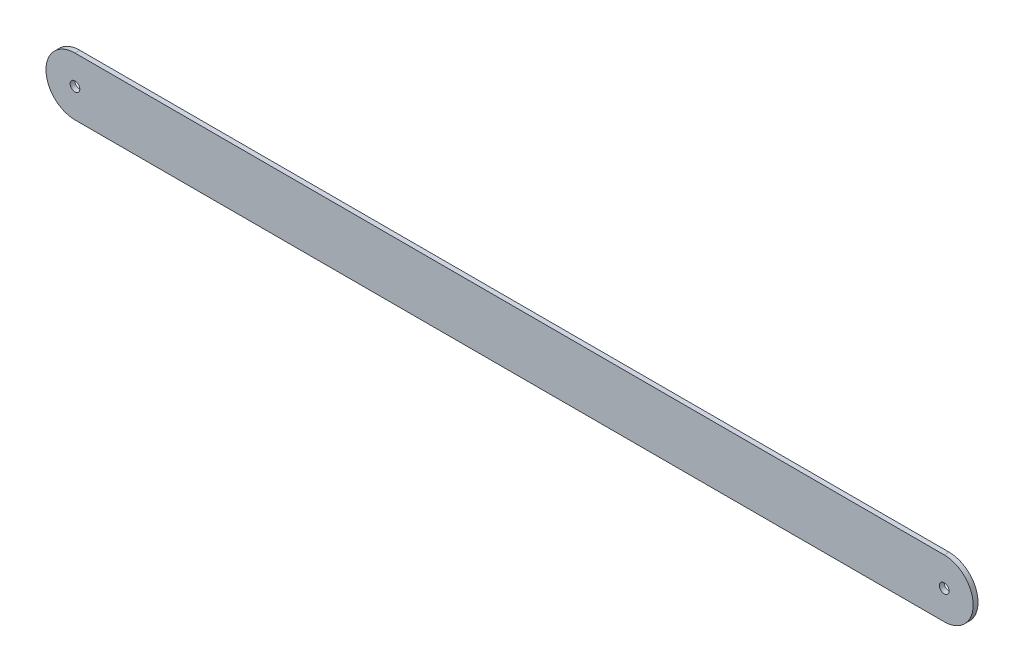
ISO-10303-21;
HEADER;
FILE_DESCRIPTION(('STEP AP214'),'2;1');
FILE_NAME('part.step','',(''),(''),'','','');
FILE_SCHEMA(('AUTOMOTIVE_DESIGN { 1 0 10303 214 1 1 1 1 }'));
ENDSEC;
DATA;
#1=APPLICATION_CONTEXT('core data for automotive mechanical design processes');
#2=APPLICATION_PROTOCOL_DEFINITION('international standard','automotive_design',2000,#1);
#3=PRODUCT_CONTEXT('',#1,'mechanical');
#4=PRODUCT('Part','Part','',(#3));
#5=PRODUCT_RELATED_PRODUCT_CATEGORY('part','',(#4));
#6=PRODUCT_DEFINITION_FORMATION('','',#4);
#7=PRODUCT_DEFINITION_CONTEXT('part definition',#1,'design');
#8=PRODUCT_DEFINITION('design','',#6,#7);
#9=PRODUCT_DEFINITION_SHAPE('','',#8);
#10=(LENGTH_UNIT() NAMED_UNIT(*) SI_UNIT(.MILLI.,.METRE.));
#11=(NAMED_UNIT(*) PLANE_ANGLE_UNIT() SI_UNIT($,.RADIAN.));
#12=(NAMED_UNIT(*) SI_UNIT($,.STERADIAN.) SOLID_ANGLE_UNIT());
#13=UNCERTAINTY_MEASURE_WITH_UNIT(LENGTH_MEASURE(1.E-05),#10,'distance_accuracy_value','');
#14=(GEOMETRIC_REPRESENTATION_CONTEXT(3) GLOBAL_UNCERTAINTY_ASSIGNED_CONTEXT((#13)) GLOBAL_UNIT_ASSIGNED_CONTEXT((#10,
#11,#12)) REPRESENTATION_CONTEXT('',''));
#15=CARTESIAN_POINT('',(0.,0.,0.));
#16=DIRECTION('',(0.,0.,1.));
#17=DIRECTION('',(1.,0.,0.));
#18=AXIS2_PLACEMENT_3D('',#15,#16,#17);
#19=CARTESIAN_POINT('',(0.,0.,1.));
#20=DIRECTION('',(0.,0.,1.));
#21=DIRECTION('',(1.,0.,0.));
#22=AXIS2_PLACEMENT_3D('',#19,#20,#21);
#23=PLANE('',#22);
#24=CARTESIAN_POINT('',(0.,0.,1.));
#25=DIRECTION('',(0.,0.,1.));
#26=DIRECTION('',(1.,0.,0.));
#27=AXIS2_PLACEMENT_3D('',#24,#25,#26);
#28=CIRCLE('',#27,1.);
#29=CARTESIAN_POINT('',(1.,0.,1.));
#30=VERTEX_POINT('',#29);
#31=EDGE_CURVE('E106',#30,#30,#28,.T.);
#32=ORIENTED_EDGE('',*,*,#31,.F.);
#33=EDGE_LOOP('',(#32));
#34=FACE_BOUND('',#33,.T.);
#35=CARTESIAN_POINT('',(0.,0.,1.));
#36=DIRECTION('',(0.,0.,1.));
#37=DIRECTION('',(1.,0.,0.));
#38=AXIS2_PLACEMENT_3D('',#35,#36,#37);
#39=CIRCLE('',#38,6.);
#40=CARTESIAN_POINT('',(0.,6.,1.));
#41=VERTEX_POINT('',#40);
#42=CARTESIAN_POINT('',(0.,-6.,1.));
#43=VERTEX_POINT('',#42);
#44=EDGE_CURVE('E91',#41,#43,#39,.T.);
#45=ORIENTED_EDGE('',*,*,#44,.T.);
#46=DIRECTION('',(1.,0.,0.));
#47=VECTOR('',#46,1.);
#48=CARTESIAN_POINT('',(0.,-6.,1.));
#49=LINE('',#48,#47);
#50=CARTESIAN_POINT('',(180.,-6.,1.));
#51=VERTEX_POINT('',#50);
#52=EDGE_CURVE('E86',#43,#51,#49,.T.);
#53=ORIENTED_EDGE('',*,*,#52,.T.);
#54=CARTESIAN_POINT('',(180.,0.,1.));
#55=DIRECTION('',(0.,0.,1.));
#56=DIRECTION('',(1.,0.,0.));
#57=AXIS2_PLACEMENT_3D('',#54,#55,#56);
#58=CIRCLE('',#57,6.);
#59=CARTESIAN_POINT('',(180.,6.,1.));
#60=VERTEX_POINT('',#59);
#61=EDGE_CURVE('E89',#51,#60,#58,.T.);
#62=ORIENTED_EDGE('',*,*,#61,.T.);
#63=DIRECTION('',(-1.,0.,0.));
#64=VECTOR('',#63,1.);
#65=CARTESIAN_POINT('',(0.,6.,1.));
#66=LINE('',#65,#64);
#67=EDGE_CURVE('E56',#60,#41,#66,.T.);
#68=ORIENTED_EDGE('',*,*,#67,.T.);
#69=EDGE_LOOP('',(#45,#53,#62,#68));
#70=FACE_BOUND('',#69,.T.);
#71=CARTESIAN_POINT('',(180.,0.,1.));
#72=DIRECTION('',(0.,0.,1.));
#73=DIRECTION('',(1.,0.,0.));
#74=AXIS2_PLACEMENT_3D('',#71,#72,#73);
#75=CIRCLE('',#74,0.999999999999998);
#76=CARTESIAN_POINT('',(181.,0.,1.));
#77=VERTEX_POINT('',#76);
#78=EDGE_CURVE('E121',#77,#77,#75,.T.);
#79=ORIENTED_EDGE('',*,*,#78,.F.);
#80=EDGE_LOOP('',(#79));
#81=FACE_BOUND('',#80,.T.);
#82=ADVANCED_FACE('F39',(#34,#70,#81),#23,.T.);
#83=CARTESIAN_POINT('',(0.,0.,0.));
#84=DIRECTION('',(0.,0.,1.));
#85=DIRECTION('',(1.,0.,0.));
#86=AXIS2_PLACEMENT_3D('',#83,#84,#85);
#87=PLANE('',#86);
#88=CARTESIAN_POINT('',(0.,0.,0.));
#89=DIRECTION('',(0.,0.,1.));
#90=DIRECTION('',(1.,0.,0.));
#91=AXIS2_PLACEMENT_3D('',#88,#89,#90);
#92=CIRCLE('',#91,6.);
#93=CARTESIAN_POINT('',(0.,6.,0.));
#94=VERTEX_POINT('',#93);
#95=CARTESIAN_POINT('',(0.,-6.,0.));
#96=VERTEX_POINT('',#95);
#97=EDGE_CURVE('E103',#94,#96,#92,.T.);
#98=ORIENTED_EDGE('',*,*,#97,.F.);
#99=DIRECTION('',(-1.,0.,0.));
#100=VECTOR('',#99,1.);
#101=CARTESIAN_POINT('',(0.,6.,0.));
#102=LINE('',#101,#100);
#103=CARTESIAN_POINT('',(180.,6.,0.));
#104=VERTEX_POINT('',#103);
#105=EDGE_CURVE('E79',#104,#94,#102,.T.);
#106=ORIENTED_EDGE('',*,*,#105,.F.);
#107=CARTESIAN_POINT('',(180.,0.,0.));
#108=DIRECTION('',(0.,0.,1.));
#109=DIRECTION('',(1.,0.,0.));
#110=AXIS2_PLACEMENT_3D('',#107,#108,#109);
#111=CIRCLE('',#110,6.);
#112=CARTESIAN_POINT('',(180.,-6.,0.));
#113=VERTEX_POINT('',#112);
#114=EDGE_CURVE('E73',#113,#104,#111,.T.);
#115=ORIENTED_EDGE('',*,*,#114,.F.);
#116=DIRECTION('',(1.,0.,0.));
#117=VECTOR('',#116,1.);
#118=CARTESIAN_POINT('',(0.,-6.,0.));
#119=LINE('',#118,#117);
#120=EDGE_CURVE('E95',#96,#113,#119,.T.);
#121=ORIENTED_EDGE('',*,*,#120,.F.);
#122=EDGE_LOOP('',(#98,#106,#115,#121));
#123=FACE_BOUND('',#122,.T.);
#124=CARTESIAN_POINT('',(0.,0.,0.));
#125=DIRECTION('',(0.,0.,1.));
#126=DIRECTION('',(1.,0.,0.));
#127=AXIS2_PLACEMENT_3D('',#124,#125,#126);
#128=CIRCLE('',#127,1.);
#129=CARTESIAN_POINT('',(1.,0.,0.));
#130=VERTEX_POINT('',#129);
#131=EDGE_CURVE('E118',#130,#130,#128,.T.);
#132=ORIENTED_EDGE('',*,*,#131,.T.);
#133=EDGE_LOOP('',(#132));
#134=FACE_BOUND('',#133,.T.);
#135=CARTESIAN_POINT('',(180.,0.,0.));
#136=DIRECTION('',(0.,0.,1.));
#137=DIRECTION('',(1.,0.,0.));
#138=AXIS2_PLACEMENT_3D('',#135,#136,#137);
#139=CIRCLE('',#138,0.999999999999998);
#140=CARTESIAN_POINT('',(181.,0.,0.));
#141=VERTEX_POINT('',#140);
#142=EDGE_CURVE('E124',#141,#141,#139,.T.);
#143=ORIENTED_EDGE('',*,*,#142,.T.);
#144=EDGE_LOOP('',(#143));
#145=FACE_BOUND('',#144,.T.);
#146=ADVANCED_FACE('F114',(#123,#134,#145),#87,.F.);
#147=CARTESIAN_POINT('',(0.,0.,1.));
#148=DIRECTION('',(0.,0.,-1.));
#149=DIRECTION('',(-1.,0.,0.));
#150=AXIS2_PLACEMENT_3D('',#147,#148,#149);
#151=CYLINDRICAL_SURFACE('',#150,6.);
#152=ORIENTED_EDGE('',*,*,#97,.T.);
#153=DIRECTION('',(0.,0.,-1.));
#154=VECTOR('',#153,1.);
#155=CARTESIAN_POINT('',(0.,-6.,1.));
#156=LINE('',#155,#154);
#157=EDGE_CURVE('E11',#43,#96,#156,.T.);
#158=ORIENTED_EDGE('',*,*,#157,.F.);
#159=ORIENTED_EDGE('',*,*,#44,.F.);
#160=DIRECTION('',(0.,0.,-1.));
#161=VECTOR('',#160,1.);
#162=CARTESIAN_POINT('',(0.,6.,1.));
#163=LINE('',#162,#161);
#164=EDGE_CURVE('E99',#41,#94,#163,.T.);
#165=ORIENTED_EDGE('',*,*,#164,.T.);
#166=EDGE_LOOP('',(#152,#158,#159,#165));
#167=FACE_BOUND('',#166,.T.);
#168=ADVANCED_FACE('F41',(#167),#151,.T.);
#169=CARTESIAN_POINT('',(0.,-6.,1.));
#170=DIRECTION('',(0.,1.,0.));
#171=DIRECTION('',(0.,0.,1.));
#172=AXIS2_PLACEMENT_3D('',#169,#170,#171);
#173=PLANE('',#172);
#174=ORIENTED_EDGE('',*,*,#120,.T.);
#175=DIRECTION('',(0.,0.,-1.));
#176=VECTOR('',#175,1.);
#177=CARTESIAN_POINT('',(180.,-6.,1.));
#178=LINE('',#177,#176);
#179=EDGE_CURVE('E48',#51,#113,#178,.T.);
#180=ORIENTED_EDGE('',*,*,#179,.F.);
#181=ORIENTED_EDGE('',*,*,#52,.F.);
#182=ORIENTED_EDGE('',*,*,#157,.T.);
#183=EDGE_LOOP('',(#174,#180,#181,#182));
#184=FACE_BOUND('',#183,.T.);
#185=ADVANCED_FACE('F94',(#184),#173,.F.);
#186=CARTESIAN_POINT('',(180.,0.,1.));
#187=DIRECTION('',(0.,0.,-1.));
#188=DIRECTION('',(-1.,0.,0.));
#189=AXIS2_PLACEMENT_3D('',#186,#187,#188);
#190=CYLINDRICAL_SURFACE('',#189,6.);
#191=ORIENTED_EDGE('',*,*,#114,.T.);
#192=DIRECTION('',(0.,0.,-1.));
#193=VECTOR('',#192,1.);
#194=CARTESIAN_POINT('',(180.,6.,1.));
#195=LINE('',#194,#193);
#196=EDGE_CURVE('E96',#60,#104,#195,.T.);
#197=ORIENTED_EDGE('',*,*,#196,.F.);
#198=ORIENTED_EDGE('',*,*,#61,.F.);
#199=ORIENTED_EDGE('',*,*,#179,.T.);
#200=EDGE_LOOP('',(#191,#197,#198,#199));
#201=FACE_BOUND('',#200,.T.);
#202=ADVANCED_FACE('F97',(#201),#190,.T.);
#203=CARTESIAN_POINT('',(0.,6.,1.));
#204=DIRECTION('',(0.,-1.,0.));
#205=DIRECTION('',(0.,0.,-1.));
#206=AXIS2_PLACEMENT_3D('',#203,#204,#205);
#207=PLANE('',#206);
#208=ORIENTED_EDGE('',*,*,#105,.T.);
#209=ORIENTED_EDGE('',*,*,#164,.F.);
#210=ORIENTED_EDGE('',*,*,#67,.F.);
#211=ORIENTED_EDGE('',*,*,#196,.T.);
#212=EDGE_LOOP('',(#208,#209,#210,#211));
#213=FACE_BOUND('',#212,.T.);
#214=ADVANCED_FACE('F111',(#213),#207,.F.);
#215=CARTESIAN_POINT('',(0.,0.,1.));
#216=DIRECTION('',(0.,0.,-1.));
#217=DIRECTION('',(-1.,0.,0.));
#218=AXIS2_PLACEMENT_3D('',#215,#216,#217);
#219=CYLINDRICAL_SURFACE('',#218,1.);
#220=ORIENTED_EDGE('',*,*,#31,.T.);
#221=EDGE_LOOP('',(#220));
#222=FACE_BOUND('',#221,.T.);
#223=ORIENTED_EDGE('',*,*,#131,.F.);
#224=EDGE_LOOP('',(#223));
#225=FACE_BOUND('',#224,.T.);
#226=ADVANCED_FACE('F141',(#222,#225),#219,.F.);
#227=CARTESIAN_POINT('',(180.,0.,1.));
#228=DIRECTION('',(0.,0.,-1.));
#229=DIRECTION('',(-1.,0.,0.));
#230=AXIS2_PLACEMENT_3D('',#227,#228,#229);
#231=CYLINDRICAL_SURFACE('',#230,0.999999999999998);
#232=ORIENTED_EDGE('',*,*,#78,.T.);
#233=EDGE_LOOP('',(#232));
#234=FACE_BOUND('',#233,.T.);
#235=ORIENTED_EDGE('',*,*,#142,.F.);
#236=EDGE_LOOP('',(#235));
#237=FACE_BOUND('',#236,.T.);
#238=ADVANCED_FACE('F130',(#234,#237),#231,.F.);
#239=CLOSED_SHELL('',(#82,#146,#168,#185,#202,#214,#226,#238));
#240=MANIFOLD_SOLID_BREP('B2',#239);
#241=ADVANCED_BREP_SHAPE_REPRESENTATION('',(#18,#240),#14);
#242=SHAPE_DEFINITION_REPRESENTATION(#9,#241);
ENDSEC;
END-ISO-10303-21;
